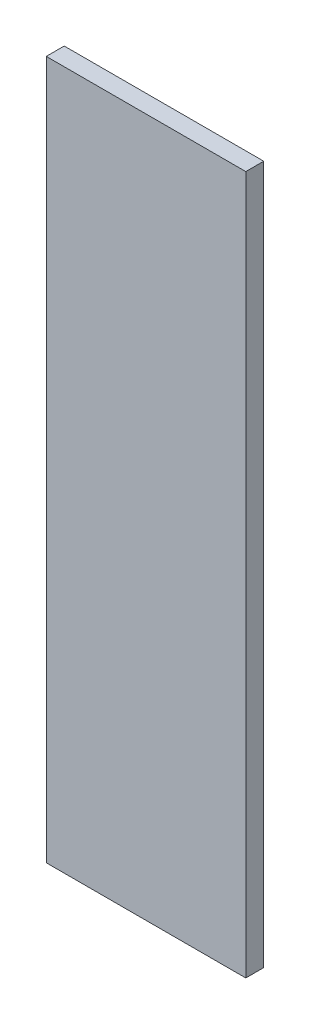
ISO-10303-21;
HEADER;
FILE_DESCRIPTION(('STEP AP214'),'2;1');
FILE_NAME('part.step','',(''),(''),'','','');
FILE_SCHEMA(('AUTOMOTIVE_DESIGN { 1 0 10303 214 1 1 1 1 }'));
ENDSEC;
DATA;
#1=APPLICATION_CONTEXT('core data for automotive mechanical design processes');
#2=APPLICATION_PROTOCOL_DEFINITION('international standard','automotive_design',2000,#1);
#3=PRODUCT_CONTEXT('',#1,'mechanical');
#4=PRODUCT('Part','Part','',(#3));
#5=PRODUCT_RELATED_PRODUCT_CATEGORY('part','',(#4));
#6=PRODUCT_DEFINITION_FORMATION('','',#4);
#7=PRODUCT_DEFINITION_CONTEXT('part definition',#1,'design');
#8=PRODUCT_DEFINITION('design','',#6,#7);
#9=PRODUCT_DEFINITION_SHAPE('','',#8);
#10=(LENGTH_UNIT() NAMED_UNIT(*) SI_UNIT(.MILLI.,.METRE.));
#11=(NAMED_UNIT(*) PLANE_ANGLE_UNIT() SI_UNIT($,.RADIAN.));
#12=(NAMED_UNIT(*) SI_UNIT($,.STERADIAN.) SOLID_ANGLE_UNIT());
#13=UNCERTAINTY_MEASURE_WITH_UNIT(LENGTH_MEASURE(1.E-05),#10,'distance_accuracy_value','');
#14=(GEOMETRIC_REPRESENTATION_CONTEXT(3) GLOBAL_UNCERTAINTY_ASSIGNED_CONTEXT((#13)) GLOBAL_UNIT_ASSIGNED_CONTEXT((#10,
#11,#12)) REPRESENTATION_CONTEXT('',''));
#15=CARTESIAN_POINT('',(0.,0.,0.));
#16=DIRECTION('',(0.,0.,1.));
#17=DIRECTION('',(1.,0.,0.));
#18=AXIS2_PLACEMENT_3D('',#15,#16,#17);
#19=CARTESIAN_POINT('',(99.9999999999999,350.,18.));
#20=DIRECTION('',(-1.,0.,0.));
#21=DIRECTION('',(0.,-1.,0.));
#22=AXIS2_PLACEMENT_3D('',#19,#20,#21);
#23=PLANE('',#22);
#24=DIRECTION('',(0.,1.,0.));
#25=VECTOR('',#24,1.);
#26=CARTESIAN_POINT('',(99.9999999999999,350.,0.));
#27=LINE('',#26,#25);
#28=CARTESIAN_POINT('',(100.,-350.,0.));
#29=VERTEX_POINT('',#28);
#30=CARTESIAN_POINT('',(99.9999999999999,350.,0.));
#31=VERTEX_POINT('',#30);
#32=EDGE_CURVE('E95',#29,#31,#27,.T.);
#33=ORIENTED_EDGE('',*,*,#32,.T.);
#34=DIRECTION('',(0.,0.,-1.));
#35=VECTOR('',#34,1.);
#36=CARTESIAN_POINT('',(99.9999999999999,350.,18.));
#37=LINE('',#36,#35);
#38=CARTESIAN_POINT('',(99.9999999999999,350.,18.));
#39=VERTEX_POINT('',#38);
#40=EDGE_CURVE('E11',#39,#31,#37,.T.);
#41=ORIENTED_EDGE('',*,*,#40,.F.);
#42=DIRECTION('',(0.,1.,0.));
#43=VECTOR('',#42,1.);
#44=CARTESIAN_POINT('',(99.9999999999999,350.,18.));
#45=LINE('',#44,#43);
#46=CARTESIAN_POINT('',(100.,-350.,18.));
#47=VERTEX_POINT('',#46);
#48=EDGE_CURVE('E83',#47,#39,#45,.T.);
#49=ORIENTED_EDGE('',*,*,#48,.F.);
#50=DIRECTION('',(0.,0.,-1.));
#51=VECTOR('',#50,1.);
#52=CARTESIAN_POINT('',(100.,-350.,18.));
#53=LINE('',#52,#51);
#54=EDGE_CURVE('E91',#47,#29,#53,.T.);
#55=ORIENTED_EDGE('',*,*,#54,.T.);
#56=EDGE_LOOP('',(#33,#41,#49,#55));
#57=FACE_BOUND('',#56,.T.);
#58=ADVANCED_FACE('F32',(#57),#23,.F.);
#59=CARTESIAN_POINT('',(-100.,350.,18.));
#60=DIRECTION('',(0.,-1.,0.));
#61=DIRECTION('',(0.,0.,-1.));
#62=AXIS2_PLACEMENT_3D('',#59,#60,#61);
#63=PLANE('',#62);
#64=DIRECTION('',(-1.,0.,0.));
#65=VECTOR('',#64,1.);
#66=CARTESIAN_POINT('',(-100.,350.,0.));
#67=LINE('',#66,#65);
#68=CARTESIAN_POINT('',(-100.,350.,0.));
#69=VERTEX_POINT('',#68);
#70=EDGE_CURVE('E87',#31,#69,#67,.T.);
#71=ORIENTED_EDGE('',*,*,#70,.T.);
#72=DIRECTION('',(0.,0.,-1.));
#73=VECTOR('',#72,1.);
#74=CARTESIAN_POINT('',(-100.,350.,18.));
#75=LINE('',#74,#73);
#76=CARTESIAN_POINT('',(-100.,350.,18.));
#77=VERTEX_POINT('',#76);
#78=EDGE_CURVE('E40',#77,#69,#75,.T.);
#79=ORIENTED_EDGE('',*,*,#78,.F.);
#80=DIRECTION('',(-1.,0.,0.));
#81=VECTOR('',#80,1.);
#82=CARTESIAN_POINT('',(-100.,350.,18.));
#83=LINE('',#82,#81);
#84=EDGE_CURVE('E78',#39,#77,#83,.T.);
#85=ORIENTED_EDGE('',*,*,#84,.F.);
#86=ORIENTED_EDGE('',*,*,#40,.T.);
#87=EDGE_LOOP('',(#71,#79,#85,#86));
#88=FACE_BOUND('',#87,.T.);
#89=ADVANCED_FACE('F86',(#88),#63,.F.);
#90=CARTESIAN_POINT('',(-100.,350.,18.));
#91=DIRECTION('',(1.,0.,0.));
#92=DIRECTION('',(0.,1.,0.));
#93=AXIS2_PLACEMENT_3D('',#90,#91,#92);
#94=PLANE('',#93);
#95=DIRECTION('',(0.,-1.,0.));
#96=VECTOR('',#95,1.);
#97=CARTESIAN_POINT('',(-100.,350.,0.));
#98=LINE('',#97,#96);
#99=CARTESIAN_POINT('',(-100.,-350.,0.));
#100=VERTEX_POINT('',#99);
#101=EDGE_CURVE('E65',#69,#100,#98,.T.);
#102=ORIENTED_EDGE('',*,*,#101,.T.);
#103=DIRECTION('',(0.,0.,-1.));
#104=VECTOR('',#103,1.);
#105=CARTESIAN_POINT('',(-100.,-350.,18.));
#106=LINE('',#105,#104);
#107=CARTESIAN_POINT('',(-100.,-350.,18.));
#108=VERTEX_POINT('',#107);
#109=EDGE_CURVE('E88',#108,#100,#106,.T.);
#110=ORIENTED_EDGE('',*,*,#109,.F.);
#111=DIRECTION('',(0.,-1.,0.));
#112=VECTOR('',#111,1.);
#113=CARTESIAN_POINT('',(-100.,350.,18.));
#114=LINE('',#113,#112);
#115=EDGE_CURVE('E81',#77,#108,#114,.T.);
#116=ORIENTED_EDGE('',*,*,#115,.F.);
#117=ORIENTED_EDGE('',*,*,#78,.T.);
#118=EDGE_LOOP('',(#102,#110,#116,#117));
#119=FACE_BOUND('',#118,.T.);
#120=ADVANCED_FACE('F89',(#119),#94,.F.);
#121=CARTESIAN_POINT('',(-100.,-350.,18.));
#122=DIRECTION('',(0.,1.,0.));
#123=DIRECTION('',(0.,0.,1.));
#124=AXIS2_PLACEMENT_3D('',#121,#122,#123);
#125=PLANE('',#124);
#126=DIRECTION('',(1.,0.,0.));
#127=VECTOR('',#126,1.);
#128=CARTESIAN_POINT('',(-100.,-350.,0.));
#129=LINE('',#128,#127);
#130=EDGE_CURVE('E71',#100,#29,#129,.T.);
#131=ORIENTED_EDGE('',*,*,#130,.T.);
#132=ORIENTED_EDGE('',*,*,#54,.F.);
#133=DIRECTION('',(1.,0.,0.));
#134=VECTOR('',#133,1.);
#135=CARTESIAN_POINT('',(-100.,-350.,18.));
#136=LINE('',#135,#134);
#137=EDGE_CURVE('E48',#108,#47,#136,.T.);
#138=ORIENTED_EDGE('',*,*,#137,.F.);
#139=ORIENTED_EDGE('',*,*,#109,.T.);
#140=EDGE_LOOP('',(#131,#132,#138,#139));
#141=FACE_BOUND('',#140,.T.);
#142=ADVANCED_FACE('F102',(#141),#125,.F.);
#143=CARTESIAN_POINT('',(0.,0.,18.));
#144=DIRECTION('',(0.,0.,1.));
#145=DIRECTION('',(1.,0.,0.));
#146=AXIS2_PLACEMENT_3D('',#143,#144,#145);
#147=PLANE('',#146);
#148=ORIENTED_EDGE('',*,*,#48,.T.);
#149=ORIENTED_EDGE('',*,*,#84,.T.);
#150=ORIENTED_EDGE('',*,*,#115,.T.);
#151=ORIENTED_EDGE('',*,*,#137,.T.);
#152=EDGE_LOOP('',(#148,#149,#150,#151));
#153=FACE_BOUND('',#152,.T.);
#154=ADVANCED_FACE('F79',(#153),#147,.T.);
#155=CARTESIAN_POINT('',(0.,0.,0.));
#156=DIRECTION('',(0.,0.,1.));
#157=DIRECTION('',(1.,0.,0.));
#158=AXIS2_PLACEMENT_3D('',#155,#156,#157);
#159=PLANE('',#158);
#160=ORIENTED_EDGE('',*,*,#32,.F.);
#161=ORIENTED_EDGE('',*,*,#130,.F.);
#162=ORIENTED_EDGE('',*,*,#101,.F.);
#163=ORIENTED_EDGE('',*,*,#70,.F.);
#164=EDGE_LOOP('',(#160,#161,#162,#163));
#165=FACE_BOUND('',#164,.T.);
#166=ADVANCED_FACE('F105',(#165),#159,.F.);
#167=CLOSED_SHELL('',(#58,#89,#120,#142,#154,#166));
#168=MANIFOLD_SOLID_BREP('B2',#167);
#169=ADVANCED_BREP_SHAPE_REPRESENTATION('',(#18,#168),#14);
#170=SHAPE_DEFINITION_REPRESENTATION(#9,#169);
ENDSEC;
END-ISO-10303-21;
